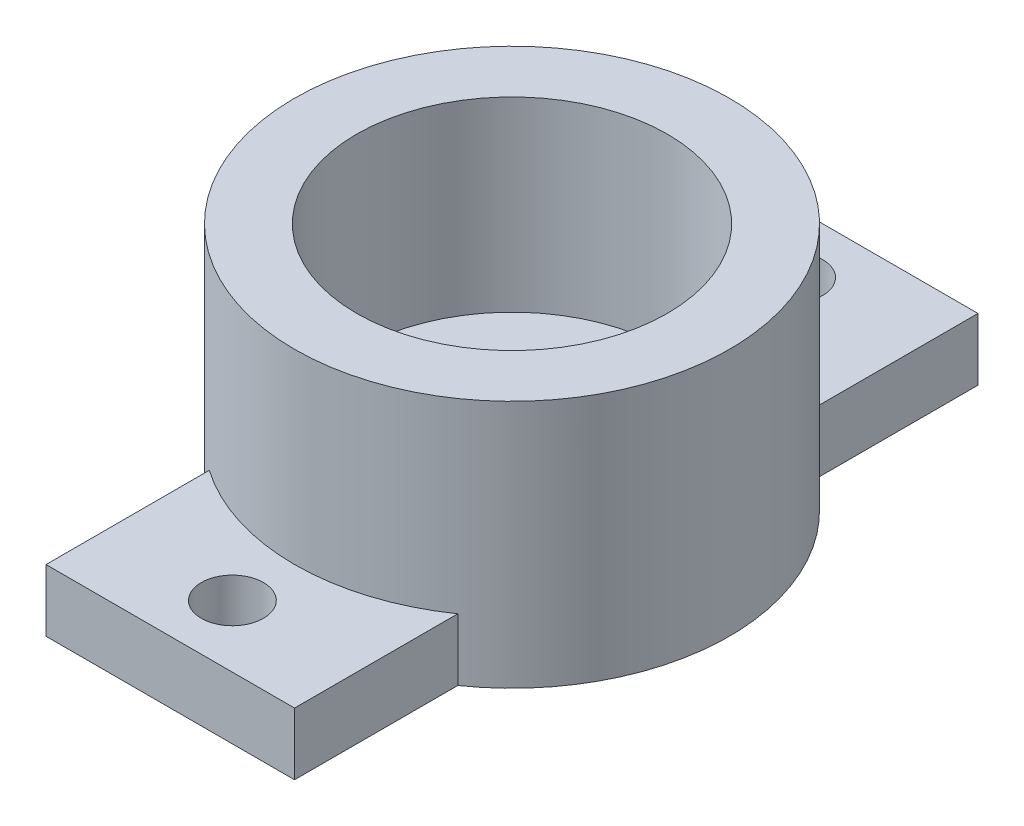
ISO-10303-21;
HEADER;
FILE_DESCRIPTION(('STEP AP214'),'2;1');
FILE_NAME('part.step','',(''),(''),'','','');
FILE_SCHEMA(('AUTOMOTIVE_DESIGN { 1 0 10303 214 1 1 1 1 }'));
ENDSEC;
DATA;
#1=APPLICATION_CONTEXT('core data for automotive mechanical design processes');
#2=APPLICATION_PROTOCOL_DEFINITION('international standard','automotive_design',2000,#1);
#3=PRODUCT_CONTEXT('',#1,'mechanical');
#4=PRODUCT('Part','Part','',(#3));
#5=PRODUCT_RELATED_PRODUCT_CATEGORY('part','',(#4));
#6=PRODUCT_DEFINITION_FORMATION('','',#4);
#7=PRODUCT_DEFINITION_CONTEXT('part definition',#1,'design');
#8=PRODUCT_DEFINITION('design','',#6,#7);
#9=PRODUCT_DEFINITION_SHAPE('','',#8);
#10=(LENGTH_UNIT() NAMED_UNIT(*) SI_UNIT(.MILLI.,.METRE.));
#11=(NAMED_UNIT(*) PLANE_ANGLE_UNIT() SI_UNIT($,.RADIAN.));
#12=(NAMED_UNIT(*) SI_UNIT($,.STERADIAN.) SOLID_ANGLE_UNIT());
#13=UNCERTAINTY_MEASURE_WITH_UNIT(LENGTH_MEASURE(1.E-05),#10,'distance_accuracy_value','');
#14=(GEOMETRIC_REPRESENTATION_CONTEXT(3) GLOBAL_UNCERTAINTY_ASSIGNED_CONTEXT((#13)) GLOBAL_UNIT_ASSIGNED_CONTEXT((#10,
#11,#12)) REPRESENTATION_CONTEXT('',''));
#15=CARTESIAN_POINT('',(0.,0.,0.));
#16=DIRECTION('',(0.,0.,1.));
#17=DIRECTION('',(1.,0.,0.));
#18=AXIS2_PLACEMENT_3D('',#15,#16,#17);
#19=CARTESIAN_POINT('',(0.,4.,0.));
#20=DIRECTION('',(0.,-1.,0.));
#21=DIRECTION('',(0.,0.,-1.));
#22=AXIS2_PLACEMENT_3D('',#19,#20,#21);
#23=CYLINDRICAL_SURFACE('',#22,3.5);
#24=CARTESIAN_POINT('',(0.,4.,0.));
#25=DIRECTION('',(0.,1.,0.));
#26=DIRECTION('',(0.,0.,1.));
#27=AXIS2_PLACEMENT_3D('',#24,#25,#26);
#28=CIRCLE('',#27,3.5);
#29=CARTESIAN_POINT('',(0.,4.,3.5));
#30=VERTEX_POINT('',#29);
#31=EDGE_CURVE('E40',#30,#30,#28,.T.);
#32=ORIENTED_EDGE('',*,*,#31,.F.);
#33=EDGE_LOOP('',(#32));
#34=FACE_BOUND('',#33,.T.);
#35=DIRECTION('',(0.,-1.,0.));
#36=VECTOR('',#35,1.);
#37=CARTESIAN_POINT('',(2.,1.,2.87228132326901));
#38=LINE('',#37,#36);
#39=CARTESIAN_POINT('',(2.,1.,2.87228132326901));
#40=VERTEX_POINT('',#39);
#41=CARTESIAN_POINT('',(2.,0.,2.87228132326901));
#42=VERTEX_POINT('',#41);
#43=EDGE_CURVE('E128',#40,#42,#38,.T.);
#44=ORIENTED_EDGE('',*,*,#43,.T.);
#45=CARTESIAN_POINT('',(0.,0.,0.));
#46=DIRECTION('',(0.,1.,0.));
#47=DIRECTION('',(0.,0.,1.));
#48=AXIS2_PLACEMENT_3D('',#45,#46,#47);
#49=CIRCLE('',#48,3.5);
#50=CARTESIAN_POINT('',(2.,0.,-2.87228132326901));
#51=VERTEX_POINT('',#50);
#52=EDGE_CURVE('E137',#42,#51,#49,.T.);
#53=ORIENTED_EDGE('',*,*,#52,.T.);
#54=DIRECTION('',(0.,-1.,0.));
#55=VECTOR('',#54,1.);
#56=CARTESIAN_POINT('',(2.,1.,-2.87228132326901));
#57=LINE('',#56,#55);
#58=CARTESIAN_POINT('',(2.,1.,-2.87228132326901));
#59=VERTEX_POINT('',#58);
#60=EDGE_CURVE('E132',#59,#51,#57,.T.);
#61=ORIENTED_EDGE('',*,*,#60,.F.);
#62=CARTESIAN_POINT('',(0.,1.,0.));
#63=DIRECTION('',(0.,-1.,0.));
#64=DIRECTION('',(0.,0.,1.));
#65=AXIS2_PLACEMENT_3D('',#62,#63,#64);
#66=CIRCLE('',#65,3.5);
#67=CARTESIAN_POINT('',(-2.,1.,-2.87228132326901));
#68=VERTEX_POINT('',#67);
#69=EDGE_CURVE('E118',#68,#59,#66,.T.);
#70=ORIENTED_EDGE('',*,*,#69,.F.);
#71=DIRECTION('',(0.,-1.,0.));
#72=VECTOR('',#71,1.);
#73=CARTESIAN_POINT('',(-2.,1.,-2.87228132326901));
#74=LINE('',#73,#72);
#75=CARTESIAN_POINT('',(-2.,0.,-2.87228132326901));
#76=VERTEX_POINT('',#75);
#77=EDGE_CURVE('E121',#68,#76,#74,.T.);
#78=ORIENTED_EDGE('',*,*,#77,.T.);
#79=CARTESIAN_POINT('',(-2.,0.,2.87228132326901));
#80=VERTEX_POINT('',#79);
#81=EDGE_CURVE('E139',#76,#80,#49,.T.);
#82=ORIENTED_EDGE('',*,*,#81,.T.);
#83=DIRECTION('',(0.,-1.,0.));
#84=VECTOR('',#83,1.);
#85=CARTESIAN_POINT('',(-2.,1.,2.87228132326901));
#86=LINE('',#85,#84);
#87=CARTESIAN_POINT('',(-2.,1.,2.87228132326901));
#88=VERTEX_POINT('',#87);
#89=EDGE_CURVE('E179',#88,#80,#86,.T.);
#90=ORIENTED_EDGE('',*,*,#89,.F.);
#91=CARTESIAN_POINT('',(0.,1.,0.));
#92=DIRECTION('',(0.,-1.,0.));
#93=DIRECTION('',(0.,0.,1.));
#94=AXIS2_PLACEMENT_3D('',#91,#92,#93);
#95=CIRCLE('',#94,3.5);
#96=EDGE_CURVE('E172',#40,#88,#95,.T.);
#97=ORIENTED_EDGE('',*,*,#96,.F.);
#98=EDGE_LOOP('',(#44,#53,#61,#70,#78,#82,#90,#97));
#99=FACE_BOUND('',#98,.T.);
#100=ADVANCED_FACE('F33',(#34,#99),#23,.T.);
#101=CARTESIAN_POINT('',(0.,4.,0.));
#102=DIRECTION('',(0.,1.,0.));
#103=DIRECTION('',(0.,0.,1.));
#104=AXIS2_PLACEMENT_3D('',#101,#102,#103);
#105=PLANE('',#104);
#106=ORIENTED_EDGE('',*,*,#31,.T.);
#107=EDGE_LOOP('',(#106));
#108=FACE_BOUND('',#107,.T.);
#109=CARTESIAN_POINT('',(0.,4.,0.));
#110=DIRECTION('',(0.,1.,0.));
#111=DIRECTION('',(0.,0.,1.));
#112=AXIS2_PLACEMENT_3D('',#109,#110,#111);
#113=CIRCLE('',#112,2.5);
#114=CARTESIAN_POINT('',(0.,4.,2.5));
#115=VERTEX_POINT('',#114);
#116=EDGE_CURVE('E134',#115,#115,#113,.T.);
#117=ORIENTED_EDGE('',*,*,#116,.F.);
#118=EDGE_LOOP('',(#117));
#119=FACE_BOUND('',#118,.T.);
#120=ADVANCED_FACE('F219',(#108,#119),#105,.T.);
#121=CARTESIAN_POINT('',(0.,0.,0.));
#122=DIRECTION('',(0.,1.,0.));
#123=DIRECTION('',(0.,0.,1.));
#124=AXIS2_PLACEMENT_3D('',#121,#122,#123);
#125=PLANE('',#124);
#126=CARTESIAN_POINT('',(0.,0.,-4.5));
#127=DIRECTION('',(0.,1.,0.));
#128=DIRECTION('',(0.,0.,1.));
#129=AXIS2_PLACEMENT_3D('',#126,#127,#128);
#130=CIRCLE('',#129,0.5);
#131=CARTESIAN_POINT('',(0.,0.,-4.));
#132=VERTEX_POINT('',#131);
#133=EDGE_CURVE('E161',#132,#132,#130,.T.);
#134=ORIENTED_EDGE('',*,*,#133,.T.);
#135=EDGE_LOOP('',(#134));
#136=FACE_BOUND('',#135,.T.);
#137=CARTESIAN_POINT('',(0.,0.,4.5));
#138=DIRECTION('',(0.,1.,0.));
#139=DIRECTION('',(0.,0.,-1.));
#140=AXIS2_PLACEMENT_3D('',#137,#138,#139);
#141=CIRCLE('',#140,0.5);
#142=CARTESIAN_POINT('',(0.,0.,4.));
#143=VERTEX_POINT('',#142);
#144=EDGE_CURVE('E155',#143,#143,#141,.T.);
#145=ORIENTED_EDGE('',*,*,#144,.T.);
#146=EDGE_LOOP('',(#145));
#147=FACE_BOUND('',#146,.T.);
#148=DIRECTION('',(0.,0.,1.));
#149=VECTOR('',#148,1.);
#150=CARTESIAN_POINT('',(-2.,0.,-2.87228132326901));
#151=LINE('',#150,#149);
#152=CARTESIAN_POINT('',(-2.,0.,-5.5));
#153=VERTEX_POINT('',#152);
#154=EDGE_CURVE('E123',#153,#76,#151,.T.);
#155=ORIENTED_EDGE('',*,*,#154,.F.);
#156=DIRECTION('',(1.,0.,0.));
#157=VECTOR('',#156,1.);
#158=CARTESIAN_POINT('',(0.,0.,-5.5));
#159=LINE('',#158,#157);
#160=CARTESIAN_POINT('',(2.,0.,-5.5));
#161=VERTEX_POINT('',#160);
#162=EDGE_CURVE('E151',#153,#161,#159,.T.);
#163=ORIENTED_EDGE('',*,*,#162,.T.);
#164=DIRECTION('',(0.,0.,-1.));
#165=VECTOR('',#164,1.);
#166=CARTESIAN_POINT('',(2.,0.,-6.5));
#167=LINE('',#166,#165);
#168=EDGE_CURVE('E112',#51,#161,#167,.T.);
#169=ORIENTED_EDGE('',*,*,#168,.F.);
#170=ORIENTED_EDGE('',*,*,#52,.F.);
#171=DIRECTION('',(0.,0.,-1.));
#172=VECTOR('',#171,1.);
#173=CARTESIAN_POINT('',(2.,0.,6.5));
#174=LINE('',#173,#172);
#175=CARTESIAN_POINT('',(2.,0.,5.5));
#176=VERTEX_POINT('',#175);
#177=EDGE_CURVE('E164',#176,#42,#174,.T.);
#178=ORIENTED_EDGE('',*,*,#177,.F.);
#179=DIRECTION('',(-1.,0.,0.));
#180=VECTOR('',#179,1.);
#181=CARTESIAN_POINT('',(0.,0.,5.5));
#182=LINE('',#181,#180);
#183=CARTESIAN_POINT('',(-2.,0.,5.5));
#184=VERTEX_POINT('',#183);
#185=EDGE_CURVE('E113',#176,#184,#182,.T.);
#186=ORIENTED_EDGE('',*,*,#185,.T.);
#187=DIRECTION('',(0.,0.,1.));
#188=VECTOR('',#187,1.);
#189=CARTESIAN_POINT('',(-2.,0.,2.87228132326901));
#190=LINE('',#189,#188);
#191=EDGE_CURVE('E173',#80,#184,#190,.T.);
#192=ORIENTED_EDGE('',*,*,#191,.F.);
#193=ORIENTED_EDGE('',*,*,#81,.F.);
#194=EDGE_LOOP('',(#155,#163,#169,#170,#178,#186,#192,#193));
#195=FACE_BOUND('',#194,.T.);
#196=ADVANCED_FACE('F150',(#136,#147,#195),#125,.F.);
#197=CARTESIAN_POINT('',(0.,4.,0.));
#198=DIRECTION('',(0.,-1.,0.));
#199=DIRECTION('',(0.,0.,-1.));
#200=AXIS2_PLACEMENT_3D('',#197,#198,#199);
#201=CYLINDRICAL_SURFACE('',#200,2.5);
#202=CARTESIAN_POINT('',(0.,1.,0.));
#203=DIRECTION('',(0.,1.,0.));
#204=DIRECTION('',(0.,0.,1.));
#205=AXIS2_PLACEMENT_3D('',#202,#203,#204);
#206=CIRCLE('',#205,2.5);
#207=CARTESIAN_POINT('',(0.,1.,2.5));
#208=VERTEX_POINT('',#207);
#209=EDGE_CURVE('E11',#208,#208,#206,.T.);
#210=ORIENTED_EDGE('',*,*,#209,.F.);
#211=EDGE_LOOP('',(#210));
#212=FACE_BOUND('',#211,.T.);
#213=ORIENTED_EDGE('',*,*,#116,.T.);
#214=EDGE_LOOP('',(#213));
#215=FACE_BOUND('',#214,.T.);
#216=ADVANCED_FACE('F230',(#212,#215),#201,.F.);
#217=CARTESIAN_POINT('',(2.,1.,-6.5));
#218=DIRECTION('',(-1.,0.,0.));
#219=DIRECTION('',(0.,0.,1.));
#220=AXIS2_PLACEMENT_3D('',#217,#218,#219);
#221=PLANE('',#220);
#222=ORIENTED_EDGE('',*,*,#168,.T.);
#223=DIRECTION('',(0.,1.,0.));
#224=VECTOR('',#223,1.);
#225=CARTESIAN_POINT('',(2.,-9.,-5.5));
#226=LINE('',#225,#224);
#227=CARTESIAN_POINT('',(2.,1.,-5.5));
#228=VERTEX_POINT('',#227);
#229=EDGE_CURVE('E97',#161,#228,#226,.T.);
#230=ORIENTED_EDGE('',*,*,#229,.T.);
#231=DIRECTION('',(0.,0.,-1.));
#232=VECTOR('',#231,1.);
#233=CARTESIAN_POINT('',(2.,1.,-6.5));
#234=LINE('',#233,#232);
#235=EDGE_CURVE('E109',#59,#228,#234,.T.);
#236=ORIENTED_EDGE('',*,*,#235,.F.);
#237=ORIENTED_EDGE('',*,*,#60,.T.);
#238=EDGE_LOOP('',(#222,#230,#236,#237));
#239=FACE_BOUND('',#238,.T.);
#240=ADVANCED_FACE('F107',(#239),#221,.F.);
#241=CARTESIAN_POINT('',(-2.,1.,-2.87228132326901));
#242=DIRECTION('',(1.,0.,0.));
#243=DIRECTION('',(0.,0.,-1.));
#244=AXIS2_PLACEMENT_3D('',#241,#242,#243);
#245=PLANE('',#244);
#246=DIRECTION('',(0.,0.,1.));
#247=VECTOR('',#246,1.);
#248=CARTESIAN_POINT('',(-2.,1.,-2.87228132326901));
#249=LINE('',#248,#247);
#250=CARTESIAN_POINT('',(-2.,1.,-5.5));
#251=VERTEX_POINT('',#250);
#252=EDGE_CURVE('E119',#251,#68,#249,.T.);
#253=ORIENTED_EDGE('',*,*,#252,.F.);
#254=DIRECTION('',(0.,1.,0.));
#255=VECTOR('',#254,1.);
#256=CARTESIAN_POINT('',(-2.,-9.,-5.5));
#257=LINE('',#256,#255);
#258=EDGE_CURVE('E47',#153,#251,#257,.T.);
#259=ORIENTED_EDGE('',*,*,#258,.F.);
#260=ORIENTED_EDGE('',*,*,#154,.T.);
#261=ORIENTED_EDGE('',*,*,#77,.F.);
#262=EDGE_LOOP('',(#253,#259,#260,#261));
#263=FACE_BOUND('',#262,.T.);
#264=ADVANCED_FACE('F239',(#263),#245,.F.);
#265=CARTESIAN_POINT('',(0.,1.,0.));
#266=DIRECTION('',(0.,1.,0.));
#267=DIRECTION('',(0.,0.,1.));
#268=AXIS2_PLACEMENT_3D('',#265,#266,#267);
#269=PLANE('',#268);
#270=DIRECTION('',(1.,0.,0.));
#271=VECTOR('',#270,1.);
#272=CARTESIAN_POINT('',(-2.,1.,-5.5));
#273=LINE('',#272,#271);
#274=EDGE_CURVE('E94',#251,#228,#273,.T.);
#275=ORIENTED_EDGE('',*,*,#274,.F.);
#276=ORIENTED_EDGE('',*,*,#252,.T.);
#277=ORIENTED_EDGE('',*,*,#69,.T.);
#278=ORIENTED_EDGE('',*,*,#235,.T.);
#279=EDGE_LOOP('',(#275,#276,#277,#278));
#280=FACE_BOUND('',#279,.T.);
#281=CARTESIAN_POINT('',(0.,1.,-4.5));
#282=DIRECTION('',(0.,1.,0.));
#283=DIRECTION('',(0.,0.,1.));
#284=AXIS2_PLACEMENT_3D('',#281,#282,#283);
#285=CIRCLE('',#284,0.5);
#286=CARTESIAN_POINT('',(0.,1.,-4.));
#287=VERTEX_POINT('',#286);
#288=EDGE_CURVE('E165',#287,#287,#285,.T.);
#289=ORIENTED_EDGE('',*,*,#288,.F.);
#290=EDGE_LOOP('',(#289));
#291=FACE_BOUND('',#290,.T.);
#292=ADVANCED_FACE('F115',(#280,#291),#269,.T.);
#293=CARTESIAN_POINT('',(2.,1.,6.5));
#294=DIRECTION('',(-1.,0.,0.));
#295=DIRECTION('',(0.,0.,1.));
#296=AXIS2_PLACEMENT_3D('',#293,#294,#295);
#297=PLANE('',#296);
#298=DIRECTION('',(0.,0.,-1.));
#299=VECTOR('',#298,1.);
#300=CARTESIAN_POINT('',(2.,1.,6.5));
#301=LINE('',#300,#299);
#302=CARTESIAN_POINT('',(2.,1.,5.5));
#303=VERTEX_POINT('',#302);
#304=EDGE_CURVE('E170',#303,#40,#301,.T.);
#305=ORIENTED_EDGE('',*,*,#304,.F.);
#306=DIRECTION('',(0.,1.,0.));
#307=VECTOR('',#306,1.);
#308=CARTESIAN_POINT('',(2.,-9.,5.5));
#309=LINE('',#308,#307);
#310=EDGE_CURVE('E55',#176,#303,#309,.T.);
#311=ORIENTED_EDGE('',*,*,#310,.F.);
#312=ORIENTED_EDGE('',*,*,#177,.T.);
#313=ORIENTED_EDGE('',*,*,#43,.F.);
#314=EDGE_LOOP('',(#305,#311,#312,#313));
#315=FACE_BOUND('',#314,.T.);
#316=ADVANCED_FACE('F191',(#315),#297,.F.);
#317=CARTESIAN_POINT('',(-2.,1.,2.87228132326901));
#318=DIRECTION('',(1.,0.,0.));
#319=DIRECTION('',(0.,0.,-1.));
#320=AXIS2_PLACEMENT_3D('',#317,#318,#319);
#321=PLANE('',#320);
#322=ORIENTED_EDGE('',*,*,#191,.T.);
#323=DIRECTION('',(0.,1.,0.));
#324=VECTOR('',#323,1.);
#325=CARTESIAN_POINT('',(-2.,-9.,5.5));
#326=LINE('',#325,#324);
#327=CARTESIAN_POINT('',(-2.,1.,5.5));
#328=VERTEX_POINT('',#327);
#329=EDGE_CURVE('E102',#184,#328,#326,.T.);
#330=ORIENTED_EDGE('',*,*,#329,.T.);
#331=DIRECTION('',(0.,0.,1.));
#332=VECTOR('',#331,1.);
#333=CARTESIAN_POINT('',(-2.,1.,2.87228132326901));
#334=LINE('',#333,#332);
#335=EDGE_CURVE('E176',#88,#328,#334,.T.);
#336=ORIENTED_EDGE('',*,*,#335,.F.);
#337=ORIENTED_EDGE('',*,*,#89,.T.);
#338=EDGE_LOOP('',(#322,#330,#336,#337));
#339=FACE_BOUND('',#338,.T.);
#340=ADVANCED_FACE('F186',(#339),#321,.F.);
#341=CARTESIAN_POINT('',(0.,1.,6.5));
#342=DIRECTION('',(0.,1.,0.));
#343=DIRECTION('',(0.,0.,1.));
#344=AXIS2_PLACEMENT_3D('',#341,#342,#343);
#345=PLANE('',#344);
#346=DIRECTION('',(-1.,0.,0.));
#347=VECTOR('',#346,1.);
#348=CARTESIAN_POINT('',(-2.,1.,5.5));
#349=LINE('',#348,#347);
#350=EDGE_CURVE('E192',#303,#328,#349,.T.);
#351=ORIENTED_EDGE('',*,*,#350,.F.);
#352=ORIENTED_EDGE('',*,*,#304,.T.);
#353=ORIENTED_EDGE('',*,*,#96,.T.);
#354=ORIENTED_EDGE('',*,*,#335,.T.);
#355=EDGE_LOOP('',(#351,#352,#353,#354));
#356=FACE_BOUND('',#355,.T.);
#357=CARTESIAN_POINT('',(0.,1.,4.5));
#358=DIRECTION('',(0.,1.,0.));
#359=DIRECTION('',(0.,0.,-1.));
#360=AXIS2_PLACEMENT_3D('',#357,#358,#359);
#361=CIRCLE('',#360,0.5);
#362=CARTESIAN_POINT('',(0.,1.,4.));
#363=VERTEX_POINT('',#362);
#364=EDGE_CURVE('E152',#363,#363,#361,.T.);
#365=ORIENTED_EDGE('',*,*,#364,.F.);
#366=EDGE_LOOP('',(#365));
#367=FACE_BOUND('',#366,.T.);
#368=ADVANCED_FACE('F197',(#356,#367),#345,.T.);
#369=CARTESIAN_POINT('',(0.,1.,0.));
#370=DIRECTION('',(0.,1.,0.));
#371=DIRECTION('',(0.,0.,1.));
#372=AXIS2_PLACEMENT_3D('',#369,#370,#371);
#373=PLANE('',#372);
#374=ORIENTED_EDGE('',*,*,#209,.T.);
#375=EDGE_LOOP('',(#374));
#376=FACE_BOUND('',#375,.T.);
#377=ADVANCED_FACE('F200',(#376),#373,.T.);
#378=CARTESIAN_POINT('',(0.,0.,4.5));
#379=DIRECTION('',(0.,1.,0.));
#380=DIRECTION('',(0.,0.,1.));
#381=AXIS2_PLACEMENT_3D('',#378,#379,#380);
#382=CYLINDRICAL_SURFACE('',#381,0.5);
#383=ORIENTED_EDGE('',*,*,#144,.F.);
#384=EDGE_LOOP('',(#383));
#385=FACE_BOUND('',#384,.T.);
#386=ORIENTED_EDGE('',*,*,#364,.T.);
#387=EDGE_LOOP('',(#386));
#388=FACE_BOUND('',#387,.T.);
#389=ADVANCED_FACE('F204',(#385,#388),#382,.F.);
#390=CARTESIAN_POINT('',(0.,0.,-4.5));
#391=DIRECTION('',(0.,1.,0.));
#392=DIRECTION('',(0.,0.,1.));
#393=AXIS2_PLACEMENT_3D('',#390,#391,#392);
#394=CYLINDRICAL_SURFACE('',#393,0.5);
#395=ORIENTED_EDGE('',*,*,#133,.F.);
#396=EDGE_LOOP('',(#395));
#397=FACE_BOUND('',#396,.T.);
#398=ORIENTED_EDGE('',*,*,#288,.T.);
#399=EDGE_LOOP('',(#398));
#400=FACE_BOUND('',#399,.T.);
#401=ADVANCED_FACE('F206',(#397,#400),#394,.F.);
#402=CARTESIAN_POINT('',(-2.,-9.,5.5));
#403=DIRECTION('',(0.,0.,-1.));
#404=DIRECTION('',(-1.,0.,0.));
#405=AXIS2_PLACEMENT_3D('',#402,#403,#404);
#406=PLANE('',#405);
#407=ORIENTED_EDGE('',*,*,#310,.T.);
#408=ORIENTED_EDGE('',*,*,#350,.T.);
#409=ORIENTED_EDGE('',*,*,#329,.F.);
#410=ORIENTED_EDGE('',*,*,#185,.F.);
#411=EDGE_LOOP('',(#407,#408,#409,#410));
#412=FACE_BOUND('',#411,.T.);
#413=ADVANCED_FACE('F188',(#412),#406,.F.);
#414=CARTESIAN_POINT('',(-2.,-9.,-5.5));
#415=DIRECTION('',(0.,0.,1.));
#416=DIRECTION('',(1.,0.,0.));
#417=AXIS2_PLACEMENT_3D('',#414,#415,#416);
#418=PLANE('',#417);
#419=ORIENTED_EDGE('',*,*,#258,.T.);
#420=ORIENTED_EDGE('',*,*,#274,.T.);
#421=ORIENTED_EDGE('',*,*,#229,.F.);
#422=ORIENTED_EDGE('',*,*,#162,.F.);
#423=EDGE_LOOP('',(#419,#420,#421,#422));
#424=FACE_BOUND('',#423,.T.);
#425=ADVANCED_FACE('F96',(#424),#418,.F.);
#426=CLOSED_SHELL('',(#100,#120,#196,#216,#240,#264,#292,#316,#340,#368,#377,#389,#401,#413,#425));
#427=MANIFOLD_SOLID_BREP('B2',#426);
#428=ADVANCED_BREP_SHAPE_REPRESENTATION('',(#18,#427),#14);
#429=SHAPE_DEFINITION_REPRESENTATION(#9,#428);
ENDSEC;
END-ISO-10303-21;
